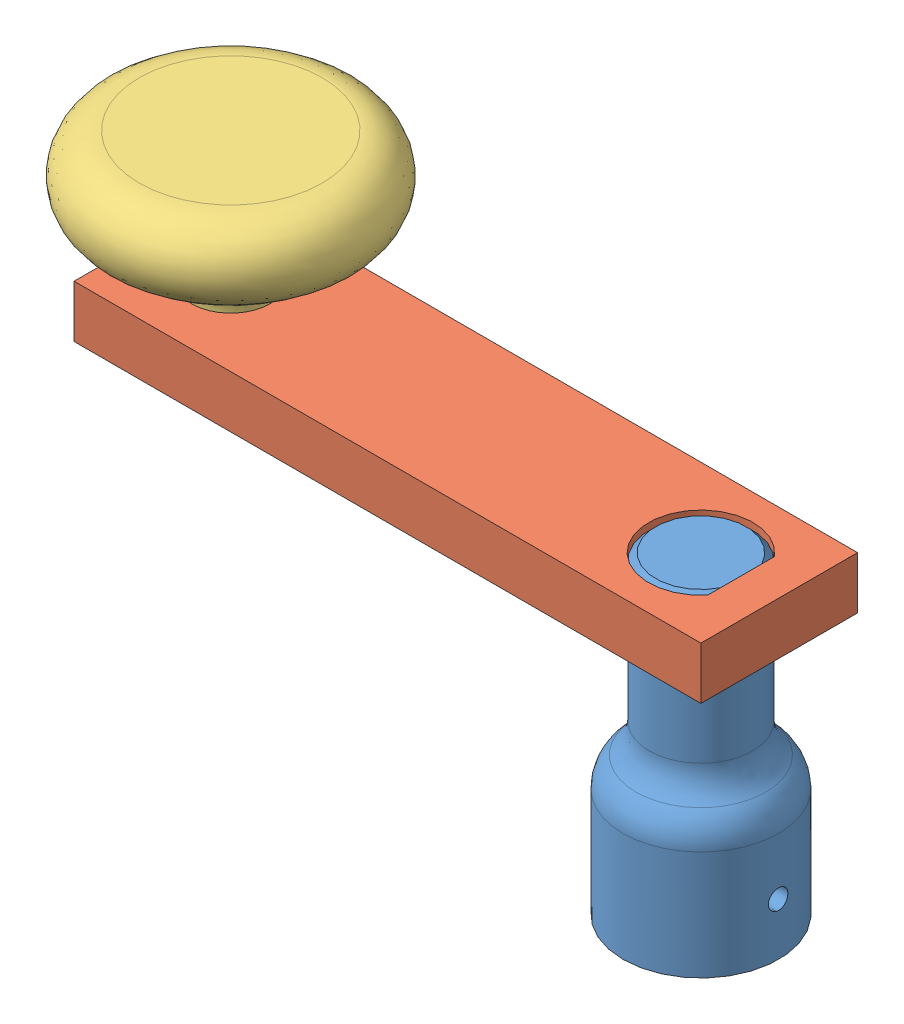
SolidWorks assembly crank sub_&.SLDASM, configuration Default (file format 15000). Lengths in mm.
Overall size (86.5 53.98 39.66).
3 component instances, 3 part files, 5 mates.
Components (placement in the parent):
- crank-shaft_&-1: crank-shaft_&.SLDPRT [Default] at origin size (18.92 38.1 18.92)
- crank-arm_&-1: crank-arm_&.SLDPRT [Default] at (-66.675 31.75 -9.525) size (76.2 6.35 19.05)
- crank-knob_&-1: crank-knob_&.SLDPRT [Default] at (-57.15 31.75 0) x (-0.956131 0 -0.292941) z (0.292941 0 -0.956131) size (31.75 22.23 31.75)
Mates (geometry in assembly coordinates):
- Concentric1: concentric anti-aligned: cylinder of crank-shaft_&-1 through (0 38.1 0) axis (0 -1 0) radius 6.2865; cylinder of crank-arm_&-1 through (0 31.75 0) axis (0 1 0) radius 6.35
- Parallel1: parallel anti-aligned: plane of crank-shaft_&-1 through (4.8895 31.75 3.9513) normal (1 0 0); plane of crank-arm_&-1 through (4.8895 31.75 -4.0516) normal (-1 0 0)
- Coincident2: coincident: plane of crank-shaft_&-1 through (0 31.75 0) normal (0 1 0); line of crank-arm_&-1 through (9.525 31.75 9.525) axis (0 0 -1)
- Concentric3: concentric anti-aligned: cylinder of crank-arm_&-1 through (-57.15 31.75 0) axis (0 1 0) radius 2.3813; cylinder of crank-knob_&-1 through (-57.15 31.75 0) axis (0 -1 0) radius 2.286
- Coincident4: coincident anti-aligned: plane of crank-arm_&-1 through (9.525 38.1 9.525) normal (0 1 0); plane of crank-knob_&-1 through (-61.7036 38.1 -1.3951) normal (0 -1 0)
